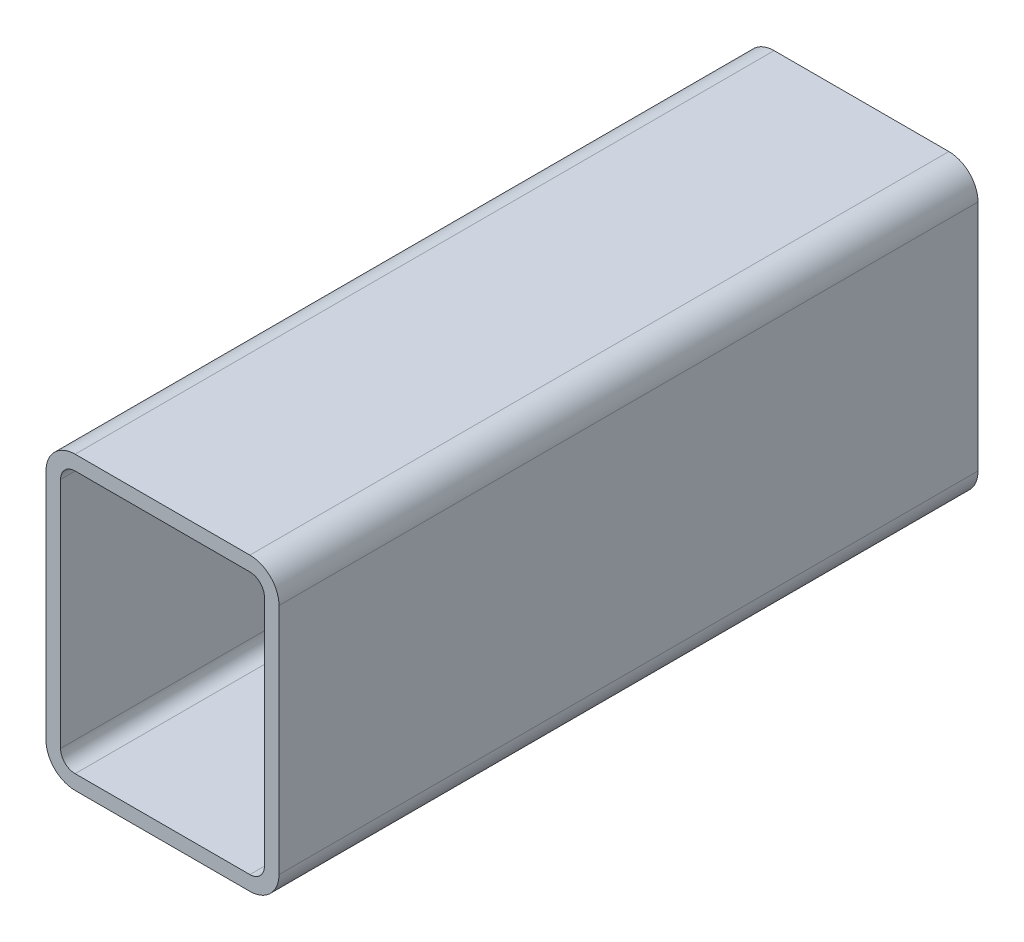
ISO-10303-21;
HEADER;
FILE_DESCRIPTION(('STEP AP214'),'2;1');
FILE_NAME('part.step','',(''),(''),'','','');
FILE_SCHEMA(('AUTOMOTIVE_DESIGN { 1 0 10303 214 1 1 1 1 }'));
ENDSEC;
DATA;
#1=APPLICATION_CONTEXT('core data for automotive mechanical design processes');
#2=APPLICATION_PROTOCOL_DEFINITION('international standard','automotive_design',2000,#1);
#3=PRODUCT_CONTEXT('',#1,'mechanical');
#4=PRODUCT('Part','Part','',(#3));
#5=PRODUCT_RELATED_PRODUCT_CATEGORY('part','',(#4));
#6=PRODUCT_DEFINITION_FORMATION('','',#4);
#7=PRODUCT_DEFINITION_CONTEXT('part definition',#1,'design');
#8=PRODUCT_DEFINITION('design','',#6,#7);
#9=PRODUCT_DEFINITION_SHAPE('','',#8);
#10=(LENGTH_UNIT() NAMED_UNIT(*) SI_UNIT(.MILLI.,.METRE.));
#11=(NAMED_UNIT(*) PLANE_ANGLE_UNIT() SI_UNIT($,.RADIAN.));
#12=(NAMED_UNIT(*) SI_UNIT($,.STERADIAN.) SOLID_ANGLE_UNIT());
#13=UNCERTAINTY_MEASURE_WITH_UNIT(LENGTH_MEASURE(1.E-05),#10,'distance_accuracy_value','');
#14=(GEOMETRIC_REPRESENTATION_CONTEXT(3) GLOBAL_UNCERTAINTY_ASSIGNED_CONTEXT((#13)) GLOBAL_UNIT_ASSIGNED_CONTEXT((#10,
#11,#12)) REPRESENTATION_CONTEXT('',''));
#15=CARTESIAN_POINT('',(0.,0.,0.));
#16=DIRECTION('',(0.,0.,1.));
#17=DIRECTION('',(1.,0.,0.));
#18=AXIS2_PLACEMENT_3D('',#15,#16,#17);
#19=CARTESIAN_POINT('',(14.3751778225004,116.33485662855,304.8));
#20=DIRECTION('',(0.,0.,1.));
#21=DIRECTION('',(1.,0.,0.));
#22=AXIS2_PLACEMENT_3D('',#19,#20,#21);
#23=PLANE('',#22);
#24=CARTESIAN_POINT('',(14.3751778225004,116.33485662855,304.8));
#25=DIRECTION('',(0.,0.,1.));
#26=DIRECTION('',(1.,0.,0.));
#27=AXIS2_PLACEMENT_3D('',#24,#25,#26);
#28=CIRCLE('',#27,12.7);
#29=CARTESIAN_POINT('',(14.3751778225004,129.03485662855,304.8));
#30=VERTEX_POINT('',#29);
#31=CARTESIAN_POINT('',(1.67517782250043,116.33485662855,304.8));
#32=VERTEX_POINT('',#31);
#33=EDGE_CURVE('E211',#30,#32,#28,.T.);
#34=ORIENTED_EDGE('',*,*,#33,.T.);
#35=DIRECTION('',(0.,-1.,0.));
#36=VECTOR('',#35,1.);
#37=CARTESIAN_POINT('',(1.67517782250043,14.73485662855,304.8));
#38=LINE('',#37,#36);
#39=CARTESIAN_POINT('',(1.67517782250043,14.73485662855,304.8));
#40=VERTEX_POINT('',#39);
#41=EDGE_CURVE('E214',#32,#40,#38,.T.);
#42=ORIENTED_EDGE('',*,*,#41,.T.);
#43=CARTESIAN_POINT('',(14.3751778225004,14.73485662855,304.8));
#44=DIRECTION('',(0.,0.,1.));
#45=DIRECTION('',(1.,0.,0.));
#46=AXIS2_PLACEMENT_3D('',#43,#44,#45);
#47=CIRCLE('',#46,12.7);
#48=CARTESIAN_POINT('',(14.3751778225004,2.03485662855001,304.8));
#49=VERTEX_POINT('',#48);
#50=EDGE_CURVE('E217',#40,#49,#47,.T.);
#51=ORIENTED_EDGE('',*,*,#50,.T.);
#52=DIRECTION('',(1.,0.,0.));
#53=VECTOR('',#52,1.);
#54=CARTESIAN_POINT('',(90.5751778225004,2.03485662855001,304.8));
#55=LINE('',#54,#53);
#56=CARTESIAN_POINT('',(90.5751778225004,2.03485662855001,304.8));
#57=VERTEX_POINT('',#56);
#58=EDGE_CURVE('E219',#49,#57,#55,.T.);
#59=ORIENTED_EDGE('',*,*,#58,.T.);
#60=CARTESIAN_POINT('',(90.5751778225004,14.73485662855,304.8));
#61=DIRECTION('',(0.,0.,1.));
#62=DIRECTION('',(1.,0.,0.));
#63=AXIS2_PLACEMENT_3D('',#60,#61,#62);
#64=CIRCLE('',#63,12.7);
#65=CARTESIAN_POINT('',(103.2751778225,14.73485662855,304.8));
#66=VERTEX_POINT('',#65);
#67=EDGE_CURVE('E221',#57,#66,#64,.T.);
#68=ORIENTED_EDGE('',*,*,#67,.T.);
#69=DIRECTION('',(0.,1.,0.));
#70=VECTOR('',#69,1.);
#71=CARTESIAN_POINT('',(103.2751778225,116.33485662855,304.8));
#72=LINE('',#71,#70);
#73=CARTESIAN_POINT('',(103.2751778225,116.33485662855,304.8));
#74=VERTEX_POINT('',#73);
#75=EDGE_CURVE('E223',#66,#74,#72,.T.);
#76=ORIENTED_EDGE('',*,*,#75,.T.);
#77=CARTESIAN_POINT('',(90.5751778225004,116.33485662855,304.8));
#78=DIRECTION('',(0.,0.,1.));
#79=DIRECTION('',(1.,0.,0.));
#80=AXIS2_PLACEMENT_3D('',#77,#78,#79);
#81=CIRCLE('',#80,12.7);
#82=CARTESIAN_POINT('',(90.5751778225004,129.03485662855,304.8));
#83=VERTEX_POINT('',#82);
#84=EDGE_CURVE('E225',#74,#83,#81,.T.);
#85=ORIENTED_EDGE('',*,*,#84,.T.);
#86=DIRECTION('',(-1.,0.,0.));
#87=VECTOR('',#86,1.);
#88=CARTESIAN_POINT('',(14.3751778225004,129.03485662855,304.8));
#89=LINE('',#88,#87);
#90=EDGE_CURVE('E227',#83,#30,#89,.T.);
#91=ORIENTED_EDGE('',*,*,#90,.T.);
#92=EDGE_LOOP('',(#34,#42,#51,#59,#68,#76,#85,#91));
#93=FACE_BOUND('',#92,.T.);
#94=DIRECTION('',(0.,-1.,0.));
#95=VECTOR('',#94,1.);
#96=CARTESIAN_POINT('',(8.02517782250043,14.73485662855,304.8));
#97=LINE('',#96,#95);
#98=CARTESIAN_POINT('',(8.02517782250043,116.33485662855,304.8));
#99=VERTEX_POINT('',#98);
#100=CARTESIAN_POINT('',(8.02517782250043,14.73485662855,304.8));
#101=VERTEX_POINT('',#100);
#102=EDGE_CURVE('E154',#99,#101,#97,.T.);
#103=ORIENTED_EDGE('',*,*,#102,.F.);
#104=CARTESIAN_POINT('',(14.3751778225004,116.33485662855,304.8));
#105=DIRECTION('',(0.,0.,1.));
#106=DIRECTION('',(1.,0.,0.));
#107=AXIS2_PLACEMENT_3D('',#104,#105,#106);
#108=CIRCLE('',#107,6.35000000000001);
#109=CARTESIAN_POINT('',(14.3751778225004,122.68485662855,304.8));
#110=VERTEX_POINT('',#109);
#111=EDGE_CURVE('E146',#110,#99,#108,.T.);
#112=ORIENTED_EDGE('',*,*,#111,.F.);
#113=DIRECTION('',(-1.,0.,0.));
#114=VECTOR('',#113,1.);
#115=CARTESIAN_POINT('',(14.3751778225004,122.68485662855,304.8));
#116=LINE('',#115,#114);
#117=CARTESIAN_POINT('',(90.5751778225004,122.68485662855,304.8));
#118=VERTEX_POINT('',#117);
#119=EDGE_CURVE('E179',#118,#110,#116,.T.);
#120=ORIENTED_EDGE('',*,*,#119,.F.);
#121=CARTESIAN_POINT('',(90.5751778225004,116.33485662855,304.8));
#122=DIRECTION('',(0.,0.,1.));
#123=DIRECTION('',(1.,0.,0.));
#124=AXIS2_PLACEMENT_3D('',#121,#122,#123);
#125=CIRCLE('',#124,6.35000000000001);
#126=CARTESIAN_POINT('',(96.9251778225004,116.33485662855,304.8));
#127=VERTEX_POINT('',#126);
#128=EDGE_CURVE('E177',#127,#118,#125,.T.);
#129=ORIENTED_EDGE('',*,*,#128,.F.);
#130=DIRECTION('',(0.,1.,0.));
#131=VECTOR('',#130,1.);
#132=CARTESIAN_POINT('',(96.9251778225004,116.33485662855,304.8));
#133=LINE('',#132,#131);
#134=CARTESIAN_POINT('',(96.9251778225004,14.73485662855,304.8));
#135=VERTEX_POINT('',#134);
#136=EDGE_CURVE('E175',#135,#127,#133,.T.);
#137=ORIENTED_EDGE('',*,*,#136,.F.);
#138=CARTESIAN_POINT('',(90.5751778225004,14.73485662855,304.8));
#139=DIRECTION('',(0.,0.,1.));
#140=DIRECTION('',(1.,0.,0.));
#141=AXIS2_PLACEMENT_3D('',#138,#139,#140);
#142=CIRCLE('',#141,6.35000000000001);
#143=CARTESIAN_POINT('',(90.5751778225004,8.38485662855,304.8));
#144=VERTEX_POINT('',#143);
#145=EDGE_CURVE('E173',#144,#135,#142,.T.);
#146=ORIENTED_EDGE('',*,*,#145,.F.);
#147=DIRECTION('',(1.,0.,0.));
#148=VECTOR('',#147,1.);
#149=CARTESIAN_POINT('',(90.5751778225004,8.38485662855,304.8));
#150=LINE('',#149,#148);
#151=CARTESIAN_POINT('',(14.3751778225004,8.38485662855,304.8));
#152=VERTEX_POINT('',#151);
#153=EDGE_CURVE('E169',#152,#144,#150,.T.);
#154=ORIENTED_EDGE('',*,*,#153,.F.);
#155=CARTESIAN_POINT('',(14.3751778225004,14.73485662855,304.8));
#156=DIRECTION('',(0.,0.,1.));
#157=DIRECTION('',(1.,0.,0.));
#158=AXIS2_PLACEMENT_3D('',#155,#156,#157);
#159=CIRCLE('',#158,6.35);
#160=EDGE_CURVE('E167',#101,#152,#159,.T.);
#161=ORIENTED_EDGE('',*,*,#160,.F.);
#162=EDGE_LOOP('',(#103,#112,#120,#129,#137,#146,#154,#161));
#163=FACE_BOUND('',#162,.T.);
#164=ADVANCED_FACE('F33',(#93,#163),#23,.T.);
#165=CARTESIAN_POINT('',(14.3751778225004,116.33485662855,0.));
#166=DIRECTION('',(0.,0.,1.));
#167=DIRECTION('',(1.,0.,0.));
#168=AXIS2_PLACEMENT_3D('',#165,#166,#167);
#169=PLANE('',#168);
#170=CARTESIAN_POINT('',(14.3751778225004,116.33485662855,0.));
#171=DIRECTION('',(0.,0.,1.));
#172=DIRECTION('',(1.,0.,0.));
#173=AXIS2_PLACEMENT_3D('',#170,#171,#172);
#174=CIRCLE('',#173,12.7);
#175=CARTESIAN_POINT('',(14.3751778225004,129.03485662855,0.));
#176=VERTEX_POINT('',#175);
#177=CARTESIAN_POINT('',(1.67517782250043,116.33485662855,0.));
#178=VERTEX_POINT('',#177);
#179=EDGE_CURVE('E162',#176,#178,#174,.T.);
#180=ORIENTED_EDGE('',*,*,#179,.F.);
#181=DIRECTION('',(-1.,0.,0.));
#182=VECTOR('',#181,1.);
#183=CARTESIAN_POINT('',(14.3751778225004,129.03485662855,0.));
#184=LINE('',#183,#182);
#185=CARTESIAN_POINT('',(90.5751778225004,129.03485662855,0.));
#186=VERTEX_POINT('',#185);
#187=EDGE_CURVE('E215',#186,#176,#184,.T.);
#188=ORIENTED_EDGE('',*,*,#187,.F.);
#189=CARTESIAN_POINT('',(90.5751778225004,116.33485662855,0.));
#190=DIRECTION('',(0.,0.,1.));
#191=DIRECTION('',(1.,0.,0.));
#192=AXIS2_PLACEMENT_3D('',#189,#190,#191);
#193=CIRCLE('',#192,12.7);
#194=CARTESIAN_POINT('',(103.2751778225,116.33485662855,0.));
#195=VERTEX_POINT('',#194);
#196=EDGE_CURVE('E242',#195,#186,#193,.T.);
#197=ORIENTED_EDGE('',*,*,#196,.F.);
#198=DIRECTION('',(0.,1.,0.));
#199=VECTOR('',#198,1.);
#200=CARTESIAN_POINT('',(103.2751778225,116.33485662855,0.));
#201=LINE('',#200,#199);
#202=CARTESIAN_POINT('',(103.2751778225,14.73485662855,0.));
#203=VERTEX_POINT('',#202);
#204=EDGE_CURVE('E240',#203,#195,#201,.T.);
#205=ORIENTED_EDGE('',*,*,#204,.F.);
#206=CARTESIAN_POINT('',(90.5751778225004,14.73485662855,0.));
#207=DIRECTION('',(0.,0.,1.));
#208=DIRECTION('',(1.,0.,0.));
#209=AXIS2_PLACEMENT_3D('',#206,#207,#208);
#210=CIRCLE('',#209,12.7);
#211=CARTESIAN_POINT('',(90.5751778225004,2.03485662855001,0.));
#212=VERTEX_POINT('',#211);
#213=EDGE_CURVE('E238',#212,#203,#210,.T.);
#214=ORIENTED_EDGE('',*,*,#213,.F.);
#215=DIRECTION('',(1.,0.,0.));
#216=VECTOR('',#215,1.);
#217=CARTESIAN_POINT('',(90.5751778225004,2.03485662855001,0.));
#218=LINE('',#217,#216);
#219=CARTESIAN_POINT('',(14.3751778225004,2.03485662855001,0.));
#220=VERTEX_POINT('',#219);
#221=EDGE_CURVE('E236',#220,#212,#218,.T.);
#222=ORIENTED_EDGE('',*,*,#221,.F.);
#223=CARTESIAN_POINT('',(14.3751778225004,14.73485662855,0.));
#224=DIRECTION('',(0.,0.,1.));
#225=DIRECTION('',(1.,0.,0.));
#226=AXIS2_PLACEMENT_3D('',#223,#224,#225);
#227=CIRCLE('',#226,12.7);
#228=CARTESIAN_POINT('',(1.67517782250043,14.73485662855,0.));
#229=VERTEX_POINT('',#228);
#230=EDGE_CURVE('E234',#229,#220,#227,.T.);
#231=ORIENTED_EDGE('',*,*,#230,.F.);
#232=DIRECTION('',(0.,-1.,0.));
#233=VECTOR('',#232,1.);
#234=CARTESIAN_POINT('',(1.67517782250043,14.73485662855,0.));
#235=LINE('',#234,#233);
#236=EDGE_CURVE('E232',#178,#229,#235,.T.);
#237=ORIENTED_EDGE('',*,*,#236,.F.);
#238=EDGE_LOOP('',(#180,#188,#197,#205,#214,#222,#231,#237));
#239=FACE_BOUND('',#238,.T.);
#240=CARTESIAN_POINT('',(14.3751778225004,116.33485662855,0.));
#241=DIRECTION('',(0.,0.,1.));
#242=DIRECTION('',(1.,0.,0.));
#243=AXIS2_PLACEMENT_3D('',#240,#241,#242);
#244=CIRCLE('',#243,6.35000000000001);
#245=CARTESIAN_POINT('',(14.3751778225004,122.68485662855,0.));
#246=VERTEX_POINT('',#245);
#247=CARTESIAN_POINT('',(8.02517782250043,116.33485662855,0.));
#248=VERTEX_POINT('',#247);
#249=EDGE_CURVE('E56',#246,#248,#244,.T.);
#250=ORIENTED_EDGE('',*,*,#249,.T.);
#251=DIRECTION('',(0.,-1.,0.));
#252=VECTOR('',#251,1.);
#253=CARTESIAN_POINT('',(8.02517782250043,14.73485662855,0.));
#254=LINE('',#253,#252);
#255=CARTESIAN_POINT('',(8.02517782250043,14.73485662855,0.));
#256=VERTEX_POINT('',#255);
#257=EDGE_CURVE('E161',#248,#256,#254,.T.);
#258=ORIENTED_EDGE('',*,*,#257,.T.);
#259=CARTESIAN_POINT('',(14.3751778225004,14.73485662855,0.));
#260=DIRECTION('',(0.,0.,1.));
#261=DIRECTION('',(1.,0.,0.));
#262=AXIS2_PLACEMENT_3D('',#259,#260,#261);
#263=CIRCLE('',#262,6.35);
#264=CARTESIAN_POINT('',(14.3751778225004,8.38485662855,0.));
#265=VERTEX_POINT('',#264);
#266=EDGE_CURVE('E183',#256,#265,#263,.T.);
#267=ORIENTED_EDGE('',*,*,#266,.T.);
#268=DIRECTION('',(1.,0.,0.));
#269=VECTOR('',#268,1.);
#270=CARTESIAN_POINT('',(90.5751778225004,8.38485662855,0.));
#271=LINE('',#270,#269);
#272=CARTESIAN_POINT('',(90.5751778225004,8.38485662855,0.));
#273=VERTEX_POINT('',#272);
#274=EDGE_CURVE('E186',#265,#273,#271,.T.);
#275=ORIENTED_EDGE('',*,*,#274,.T.);
#276=CARTESIAN_POINT('',(90.5751778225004,14.73485662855,0.));
#277=DIRECTION('',(0.,0.,1.));
#278=DIRECTION('',(1.,0.,0.));
#279=AXIS2_PLACEMENT_3D('',#276,#277,#278);
#280=CIRCLE('',#279,6.35000000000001);
#281=CARTESIAN_POINT('',(96.9251778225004,14.73485662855,0.));
#282=VERTEX_POINT('',#281);
#283=EDGE_CURVE('E189',#273,#282,#280,.T.);
#284=ORIENTED_EDGE('',*,*,#283,.T.);
#285=DIRECTION('',(0.,1.,0.));
#286=VECTOR('',#285,1.);
#287=CARTESIAN_POINT('',(96.9251778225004,116.33485662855,0.));
#288=LINE('',#287,#286);
#289=CARTESIAN_POINT('',(96.9251778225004,116.33485662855,0.));
#290=VERTEX_POINT('',#289);
#291=EDGE_CURVE('E192',#282,#290,#288,.T.);
#292=ORIENTED_EDGE('',*,*,#291,.T.);
#293=CARTESIAN_POINT('',(90.5751778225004,116.33485662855,0.));
#294=DIRECTION('',(0.,0.,1.));
#295=DIRECTION('',(1.,0.,0.));
#296=AXIS2_PLACEMENT_3D('',#293,#294,#295);
#297=CIRCLE('',#296,6.35000000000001);
#298=CARTESIAN_POINT('',(90.5751778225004,122.68485662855,0.));
#299=VERTEX_POINT('',#298);
#300=EDGE_CURVE('E195',#290,#299,#297,.T.);
#301=ORIENTED_EDGE('',*,*,#300,.T.);
#302=DIRECTION('',(-1.,0.,0.));
#303=VECTOR('',#302,1.);
#304=CARTESIAN_POINT('',(14.3751778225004,122.68485662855,0.));
#305=LINE('',#304,#303);
#306=EDGE_CURVE('E155',#299,#246,#305,.T.);
#307=ORIENTED_EDGE('',*,*,#306,.T.);
#308=EDGE_LOOP('',(#250,#258,#267,#275,#284,#292,#301,#307));
#309=FACE_BOUND('',#308,.T.);
#310=ADVANCED_FACE('F272',(#239,#309),#169,.F.);
#311=CARTESIAN_POINT('',(14.3751778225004,116.33485662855,304.8));
#312=DIRECTION('',(0.,0.,-1.));
#313=DIRECTION('',(-1.,0.,0.));
#314=AXIS2_PLACEMENT_3D('',#311,#312,#313);
#315=CYLINDRICAL_SURFACE('',#314,12.7);
#316=ORIENTED_EDGE('',*,*,#179,.T.);
#317=DIRECTION('',(0.,0.,-1.));
#318=VECTOR('',#317,1.);
#319=CARTESIAN_POINT('',(1.67517782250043,116.33485662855,304.8));
#320=LINE('',#319,#318);
#321=EDGE_CURVE('E11',#32,#178,#320,.T.);
#322=ORIENTED_EDGE('',*,*,#321,.F.);
#323=ORIENTED_EDGE('',*,*,#33,.F.);
#324=DIRECTION('',(0.,0.,-1.));
#325=VECTOR('',#324,1.);
#326=CARTESIAN_POINT('',(14.3751778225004,129.03485662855,304.8));
#327=LINE('',#326,#325);
#328=EDGE_CURVE('E229',#30,#176,#327,.T.);
#329=ORIENTED_EDGE('',*,*,#328,.T.);
#330=EDGE_LOOP('',(#316,#322,#323,#329));
#331=FACE_BOUND('',#330,.T.);
#332=ADVANCED_FACE('F35',(#331),#315,.T.);
#333=CARTESIAN_POINT('',(1.67517782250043,14.73485662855,304.8));
#334=DIRECTION('',(1.,0.,0.));
#335=DIRECTION('',(0.,0.,-1.));
#336=AXIS2_PLACEMENT_3D('',#333,#334,#335);
#337=PLANE('',#336);
#338=ORIENTED_EDGE('',*,*,#236,.T.);
#339=DIRECTION('',(0.,0.,-1.));
#340=VECTOR('',#339,1.);
#341=CARTESIAN_POINT('',(1.67517782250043,14.73485662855,304.8));
#342=LINE('',#341,#340);
#343=EDGE_CURVE('E41',#40,#229,#342,.T.);
#344=ORIENTED_EDGE('',*,*,#343,.F.);
#345=ORIENTED_EDGE('',*,*,#41,.F.);
#346=ORIENTED_EDGE('',*,*,#321,.T.);
#347=EDGE_LOOP('',(#338,#344,#345,#346));
#348=FACE_BOUND('',#347,.T.);
#349=ADVANCED_FACE('F289',(#348),#337,.F.);
#350=CARTESIAN_POINT('',(14.3751778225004,14.73485662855,304.8));
#351=DIRECTION('',(0.,0.,-1.));
#352=DIRECTION('',(-1.,0.,0.));
#353=AXIS2_PLACEMENT_3D('',#350,#351,#352);
#354=CYLINDRICAL_SURFACE('',#353,12.7);
#355=ORIENTED_EDGE('',*,*,#230,.T.);
#356=DIRECTION('',(0.,0.,-1.));
#357=VECTOR('',#356,1.);
#358=CARTESIAN_POINT('',(14.3751778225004,2.03485662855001,304.8));
#359=LINE('',#358,#357);
#360=EDGE_CURVE('E259',#49,#220,#359,.T.);
#361=ORIENTED_EDGE('',*,*,#360,.F.);
#362=ORIENTED_EDGE('',*,*,#50,.F.);
#363=ORIENTED_EDGE('',*,*,#343,.T.);
#364=EDGE_LOOP('',(#355,#361,#362,#363));
#365=FACE_BOUND('',#364,.T.);
#366=ADVANCED_FACE('F266',(#365),#354,.T.);
#367=CARTESIAN_POINT('',(90.5751778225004,2.03485662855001,304.8));
#368=DIRECTION('',(0.,1.,0.));
#369=DIRECTION('',(0.,0.,1.));
#370=AXIS2_PLACEMENT_3D('',#367,#368,#369);
#371=PLANE('',#370);
#372=ORIENTED_EDGE('',*,*,#221,.T.);
#373=DIRECTION('',(0.,0.,-1.));
#374=VECTOR('',#373,1.);
#375=CARTESIAN_POINT('',(90.5751778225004,2.03485662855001,304.8));
#376=LINE('',#375,#374);
#377=EDGE_CURVE('E256',#57,#212,#376,.T.);
#378=ORIENTED_EDGE('',*,*,#377,.F.);
#379=ORIENTED_EDGE('',*,*,#58,.F.);
#380=ORIENTED_EDGE('',*,*,#360,.T.);
#381=EDGE_LOOP('',(#372,#378,#379,#380));
#382=FACE_BOUND('',#381,.T.);
#383=ADVANCED_FACE('F278',(#382),#371,.F.);
#384=CARTESIAN_POINT('',(90.5751778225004,14.73485662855,304.8));
#385=DIRECTION('',(0.,0.,-1.));
#386=DIRECTION('',(-1.,0.,0.));
#387=AXIS2_PLACEMENT_3D('',#384,#385,#386);
#388=CYLINDRICAL_SURFACE('',#387,12.7);
#389=ORIENTED_EDGE('',*,*,#213,.T.);
#390=DIRECTION('',(0.,0.,-1.));
#391=VECTOR('',#390,1.);
#392=CARTESIAN_POINT('',(103.2751778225,14.73485662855,304.8));
#393=LINE('',#392,#391);
#394=EDGE_CURVE('E253',#66,#203,#393,.T.);
#395=ORIENTED_EDGE('',*,*,#394,.F.);
#396=ORIENTED_EDGE('',*,*,#67,.F.);
#397=ORIENTED_EDGE('',*,*,#377,.T.);
#398=EDGE_LOOP('',(#389,#395,#396,#397));
#399=FACE_BOUND('',#398,.T.);
#400=ADVANCED_FACE('F282',(#399),#388,.T.);
#401=CARTESIAN_POINT('',(103.2751778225,116.33485662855,304.8));
#402=DIRECTION('',(-1.,0.,0.));
#403=DIRECTION('',(0.,0.,1.));
#404=AXIS2_PLACEMENT_3D('',#401,#402,#403);
#405=PLANE('',#404);
#406=ORIENTED_EDGE('',*,*,#204,.T.);
#407=DIRECTION('',(0.,0.,-1.));
#408=VECTOR('',#407,1.);
#409=CARTESIAN_POINT('',(103.2751778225,116.33485662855,304.8));
#410=LINE('',#409,#408);
#411=EDGE_CURVE('E250',#74,#195,#410,.T.);
#412=ORIENTED_EDGE('',*,*,#411,.F.);
#413=ORIENTED_EDGE('',*,*,#75,.F.);
#414=ORIENTED_EDGE('',*,*,#394,.T.);
#415=EDGE_LOOP('',(#406,#412,#413,#414));
#416=FACE_BOUND('',#415,.T.);
#417=ADVANCED_FACE('F302',(#416),#405,.F.);
#418=CARTESIAN_POINT('',(90.5751778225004,116.33485662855,304.8));
#419=DIRECTION('',(0.,0.,-1.));
#420=DIRECTION('',(-1.,0.,0.));
#421=AXIS2_PLACEMENT_3D('',#418,#419,#420);
#422=CYLINDRICAL_SURFACE('',#421,12.7);
#423=ORIENTED_EDGE('',*,*,#196,.T.);
#424=DIRECTION('',(0.,0.,-1.));
#425=VECTOR('',#424,1.);
#426=CARTESIAN_POINT('',(90.5751778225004,129.03485662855,304.8));
#427=LINE('',#426,#425);
#428=EDGE_CURVE('E247',#83,#186,#427,.T.);
#429=ORIENTED_EDGE('',*,*,#428,.F.);
#430=ORIENTED_EDGE('',*,*,#84,.F.);
#431=ORIENTED_EDGE('',*,*,#411,.T.);
#432=EDGE_LOOP('',(#423,#429,#430,#431));
#433=FACE_BOUND('',#432,.T.);
#434=ADVANCED_FACE('F300',(#433),#422,.T.);
#435=CARTESIAN_POINT('',(14.3751778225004,129.03485662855,304.8));
#436=DIRECTION('',(0.,-1.,0.));
#437=DIRECTION('',(0.,0.,-1.));
#438=AXIS2_PLACEMENT_3D('',#435,#436,#437);
#439=PLANE('',#438);
#440=ORIENTED_EDGE('',*,*,#187,.T.);
#441=ORIENTED_EDGE('',*,*,#328,.F.);
#442=ORIENTED_EDGE('',*,*,#90,.F.);
#443=ORIENTED_EDGE('',*,*,#428,.T.);
#444=EDGE_LOOP('',(#440,#441,#442,#443));
#445=FACE_BOUND('',#444,.T.);
#446=ADVANCED_FACE('F295',(#445),#439,.F.);
#447=CARTESIAN_POINT('',(14.3751778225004,116.33485662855,304.8));
#448=DIRECTION('',(0.,0.,-1.));
#449=DIRECTION('',(-1.,0.,0.));
#450=AXIS2_PLACEMENT_3D('',#447,#448,#449);
#451=CYLINDRICAL_SURFACE('',#450,6.35000000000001);
#452=ORIENTED_EDGE('',*,*,#249,.F.);
#453=DIRECTION('',(0.,0.,-1.));
#454=VECTOR('',#453,1.);
#455=CARTESIAN_POINT('',(14.3751778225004,122.68485662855,304.8));
#456=LINE('',#455,#454);
#457=EDGE_CURVE('E150',#110,#246,#456,.T.);
#458=ORIENTED_EDGE('',*,*,#457,.F.);
#459=ORIENTED_EDGE('',*,*,#111,.T.);
#460=DIRECTION('',(0.,0.,-1.));
#461=VECTOR('',#460,1.);
#462=CARTESIAN_POINT('',(8.02517782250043,116.33485662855,304.8));
#463=LINE('',#462,#461);
#464=EDGE_CURVE('E149',#99,#248,#463,.T.);
#465=ORIENTED_EDGE('',*,*,#464,.T.);
#466=EDGE_LOOP('',(#452,#458,#459,#465));
#467=FACE_BOUND('',#466,.T.);
#468=ADVANCED_FACE('F148',(#467),#451,.F.);
#469=CARTESIAN_POINT('',(8.02517782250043,14.73485662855,304.8));
#470=DIRECTION('',(1.,0.,0.));
#471=DIRECTION('',(0.,0.,-1.));
#472=AXIS2_PLACEMENT_3D('',#469,#470,#471);
#473=PLANE('',#472);
#474=ORIENTED_EDGE('',*,*,#257,.F.);
#475=ORIENTED_EDGE('',*,*,#464,.F.);
#476=ORIENTED_EDGE('',*,*,#102,.T.);
#477=DIRECTION('',(0.,0.,-1.));
#478=VECTOR('',#477,1.);
#479=CARTESIAN_POINT('',(8.02517782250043,14.73485662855,304.8));
#480=LINE('',#479,#478);
#481=EDGE_CURVE('E163',#101,#256,#480,.T.);
#482=ORIENTED_EDGE('',*,*,#481,.T.);
#483=EDGE_LOOP('',(#474,#475,#476,#482));
#484=FACE_BOUND('',#483,.T.);
#485=ADVANCED_FACE('F158',(#484),#473,.T.);
#486=CARTESIAN_POINT('',(14.3751778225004,14.73485662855,304.8));
#487=DIRECTION('',(0.,0.,-1.));
#488=DIRECTION('',(-1.,0.,0.));
#489=AXIS2_PLACEMENT_3D('',#486,#487,#488);
#490=CYLINDRICAL_SURFACE('',#489,6.35);
#491=ORIENTED_EDGE('',*,*,#266,.F.);
#492=ORIENTED_EDGE('',*,*,#481,.F.);
#493=ORIENTED_EDGE('',*,*,#160,.T.);
#494=DIRECTION('',(0.,0.,-1.));
#495=VECTOR('',#494,1.);
#496=CARTESIAN_POINT('',(14.3751778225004,8.38485662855,304.8));
#497=LINE('',#496,#495);
#498=EDGE_CURVE('E208',#152,#265,#497,.T.);
#499=ORIENTED_EDGE('',*,*,#498,.T.);
#500=EDGE_LOOP('',(#491,#492,#493,#499));
#501=FACE_BOUND('',#500,.T.);
#502=ADVANCED_FACE('F327',(#501),#490,.F.);
#503=CARTESIAN_POINT('',(90.5751778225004,8.38485662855,304.8));
#504=DIRECTION('',(0.,1.,0.));
#505=DIRECTION('',(0.,0.,1.));
#506=AXIS2_PLACEMENT_3D('',#503,#504,#505);
#507=PLANE('',#506);
#508=ORIENTED_EDGE('',*,*,#274,.F.);
#509=ORIENTED_EDGE('',*,*,#498,.F.);
#510=ORIENTED_EDGE('',*,*,#153,.T.);
#511=DIRECTION('',(0.,0.,-1.));
#512=VECTOR('',#511,1.);
#513=CARTESIAN_POINT('',(90.5751778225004,8.38485662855,304.8));
#514=LINE('',#513,#512);
#515=EDGE_CURVE('E206',#144,#273,#514,.T.);
#516=ORIENTED_EDGE('',*,*,#515,.T.);
#517=EDGE_LOOP('',(#508,#509,#510,#516));
#518=FACE_BOUND('',#517,.T.);
#519=ADVANCED_FACE('F331',(#518),#507,.T.);
#520=CARTESIAN_POINT('',(90.5751778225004,14.73485662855,304.8));
#521=DIRECTION('',(0.,0.,-1.));
#522=DIRECTION('',(-1.,0.,0.));
#523=AXIS2_PLACEMENT_3D('',#520,#521,#522);
#524=CYLINDRICAL_SURFACE('',#523,6.35000000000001);
#525=ORIENTED_EDGE('',*,*,#283,.F.);
#526=ORIENTED_EDGE('',*,*,#515,.F.);
#527=ORIENTED_EDGE('',*,*,#145,.T.);
#528=DIRECTION('',(0.,0.,-1.));
#529=VECTOR('',#528,1.);
#530=CARTESIAN_POINT('',(96.9251778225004,14.73485662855,304.8));
#531=LINE('',#530,#529);
#532=EDGE_CURVE('E204',#135,#282,#531,.T.);
#533=ORIENTED_EDGE('',*,*,#532,.T.);
#534=EDGE_LOOP('',(#525,#526,#527,#533));
#535=FACE_BOUND('',#534,.T.);
#536=ADVANCED_FACE('F337',(#535),#524,.F.);
#537=CARTESIAN_POINT('',(96.9251778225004,116.33485662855,304.8));
#538=DIRECTION('',(-1.,0.,0.));
#539=DIRECTION('',(0.,0.,1.));
#540=AXIS2_PLACEMENT_3D('',#537,#538,#539);
#541=PLANE('',#540);
#542=ORIENTED_EDGE('',*,*,#291,.F.);
#543=ORIENTED_EDGE('',*,*,#532,.F.);
#544=ORIENTED_EDGE('',*,*,#136,.T.);
#545=DIRECTION('',(0.,0.,-1.));
#546=VECTOR('',#545,1.);
#547=CARTESIAN_POINT('',(96.9251778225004,116.33485662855,304.8));
#548=LINE('',#547,#546);
#549=EDGE_CURVE('E202',#127,#290,#548,.T.);
#550=ORIENTED_EDGE('',*,*,#549,.T.);
#551=EDGE_LOOP('',(#542,#543,#544,#550));
#552=FACE_BOUND('',#551,.T.);
#553=ADVANCED_FACE('F341',(#552),#541,.T.);
#554=CARTESIAN_POINT('',(90.5751778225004,116.33485662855,304.8));
#555=DIRECTION('',(0.,0.,-1.));
#556=DIRECTION('',(-1.,0.,0.));
#557=AXIS2_PLACEMENT_3D('',#554,#555,#556);
#558=CYLINDRICAL_SURFACE('',#557,6.35000000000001);
#559=ORIENTED_EDGE('',*,*,#300,.F.);
#560=ORIENTED_EDGE('',*,*,#549,.F.);
#561=ORIENTED_EDGE('',*,*,#128,.T.);
#562=DIRECTION('',(0.,0.,-1.));
#563=VECTOR('',#562,1.);
#564=CARTESIAN_POINT('',(90.5751778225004,122.68485662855,304.8));
#565=LINE('',#564,#563);
#566=EDGE_CURVE('E48',#118,#299,#565,.T.);
#567=ORIENTED_EDGE('',*,*,#566,.T.);
#568=EDGE_LOOP('',(#559,#560,#561,#567));
#569=FACE_BOUND('',#568,.T.);
#570=ADVANCED_FACE('F345',(#569),#558,.F.);
#571=CARTESIAN_POINT('',(14.3751778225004,122.68485662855,304.8));
#572=DIRECTION('',(0.,-1.,0.));
#573=DIRECTION('',(0.,0.,-1.));
#574=AXIS2_PLACEMENT_3D('',#571,#572,#573);
#575=PLANE('',#574);
#576=ORIENTED_EDGE('',*,*,#306,.F.);
#577=ORIENTED_EDGE('',*,*,#566,.F.);
#578=ORIENTED_EDGE('',*,*,#119,.T.);
#579=ORIENTED_EDGE('',*,*,#457,.T.);
#580=EDGE_LOOP('',(#576,#577,#578,#579));
#581=FACE_BOUND('',#580,.T.);
#582=ADVANCED_FACE('F349',(#581),#575,.T.);
#583=CLOSED_SHELL('',(#164,#310,#332,#349,#366,#383,#400,#417,#434,#446,#468,#485,#502,#519,
#536,#553,#570,#582));
#584=MANIFOLD_SOLID_BREP('B2',#583);
#585=ADVANCED_BREP_SHAPE_REPRESENTATION('',(#18,#584),#14);
#586=SHAPE_DEFINITION_REPRESENTATION(#9,#585);
ENDSEC;
END-ISO-10303-21;
